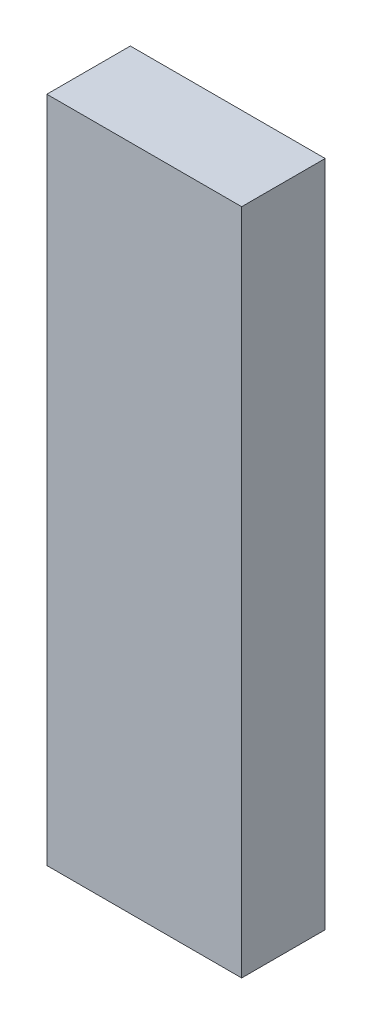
from build123d import *

# Parameters (mm, degrees)
SKETCH1_W           = 88.9
SKETCH1_H           = 38.1
BOSS_EXTRUDE1_DEPTH = 304.8


with BuildPart() as part:
    # Sketch1 → Boss-Extrude1 (new body)
    with BuildSketch(Plane(origin=(0, 0, 0), x_dir=(1, 0, 0), z_dir=(0, 1, 0))):
        with Locations((44.45, 19.05)):
            Rectangle(SKETCH1_W, SKETCH1_H)
    extrude(amount=BOSS_EXTRUDE1_DEPTH)


solid = part.part
